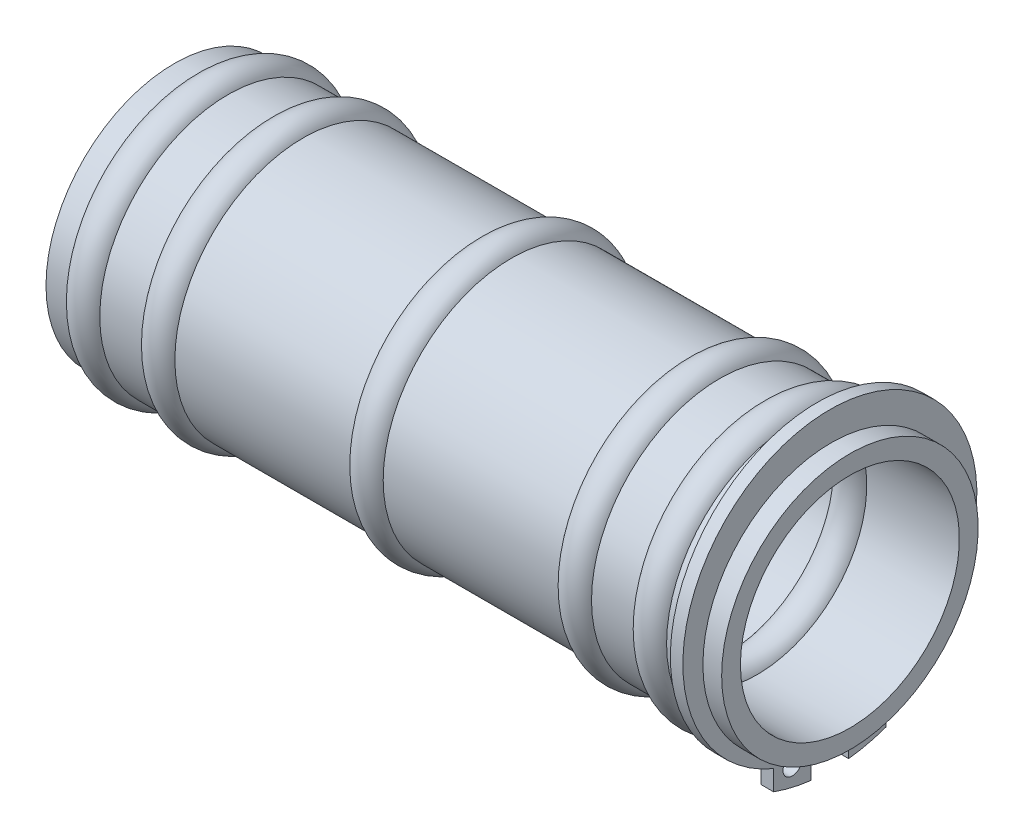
from build123d import *

# Parameters (mm, degrees)
ESQUISSE2_R      = 1.5
ESQUISSE3_R      = 0.75
EXTRUSION1_DEPTH = 1


with BuildPart() as part:
    # Esquisse1 → R_volution1 (revolve)
    with BuildSketch(Plane.XY, mode=Mode.PRIVATE) as r_volution1_sk:
        with BuildLine():
            Line((0, 8.75), (4.700961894, 8.75))
            ThreePointArc((4.700961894, 8.75), (6, 8), (7.299038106, 8.75))
            Line((7.299038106, 8.75), (44.000961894, 8.75))
            ThreePointArc((44.000961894, 8.75), (45.3, 8), (46.599038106, 8.75))
            Line((46.599038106, 8.75), (54, 8.75))
            Line((54, 8.75), (54, 10.25))
            Line((54, 10.25), (52.5, 10.25))
            Line((52.5, 10.25), (52.5, 9.5))
            Line((52.5, 9.5), (51.3, 9.5))
            Line((51.3, 9.5), (51.3, 10.25))
            Line((51.3, 10.25), (49.599038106, 10.25))
            ThreePointArc((49.599038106, 10.25), (48.3, 11), (47.000961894, 10.25))
            Line((47.000961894, 10.25), (43.599038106, 10.25))
            ThreePointArc((43.599038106, 10.25), (42.3, 11), (41.000961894, 10.25))
            Line((41.000961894, 10.25), (10.299038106, 10.25))
            ThreePointArc((10.299038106, 10.25), (9, 11), (7.700961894, 10.25))
            Line((7.700961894, 10.25), (4.299038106, 10.25))
            ThreePointArc((4.299038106, 10.25), (3, 11), (1.700961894, 10.25))
            Line((1.700961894, 10.25), (0, 10.25))
            Line((0, 10.25), (0, 8.75))
        make_face()
    revolve(r_volution1_sk.sketch.rotate(Axis((54, 0, 0), (-1, 0, 0)), 270), axis=Axis((54, 0, 0), (-1, 0, 0)))

    # Esquisse2 → R_volution2 (revolve)
    with BuildSketch(Plane.XY, mode=Mode.PRIVATE) as r_volution2_sk:
        with Locations((25.65, 9.5)):
            Circle(ESQUISSE2_R)
    revolve(r_volution2_sk.sketch.rotate(Axis((50, 0, 0), (-1, 0, 0)), 270), axis=Axis((50, 0, 0), (-1, 0, 0)))

    # Esquisse3 → Extrusion1 (add)
    with BuildSketch(Plane(origin=(51.4, 0, 0), x_dir=(0, 0, -1), z_dir=(1, 0, 0))):
        with BuildLine():
            Line((-4.5, -10.104146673), (-4.5, -11.712443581))
            ThreePointArc((-4.5, -11.712443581), (-3.020485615, -12.151130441), (-1.5, -12.414820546))
            Line((-1.5, -12.414820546), (-1.5, -9.178235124))
            ThreePointArc((-1.5, -9.178235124), (0, 9.3), (1.5, -9.178235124))
            Line((1.5, -9.178235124), (1.5, -12.414820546))
            ThreePointArc((1.5, -12.414820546), (3.020485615, -12.151130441), (4.5, -11.712443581))
            Line((4.5, -11.712443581), (4.5, -10.104146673))
            ThreePointArc((4.5, -10.104146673), (0, 12.5), (-4.5, -10.104146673))
        make_face()
        with Locations((3, -10.610567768)):
            Circle(ESQUISSE3_R, mode=Mode.SUBTRACT)
        with Locations((-3, -10.610567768)):
            Circle(ESQUISSE3_R, mode=Mode.SUBTRACT)
    extrude(amount=EXTRUSION1_DEPTH)


solid = part.part
